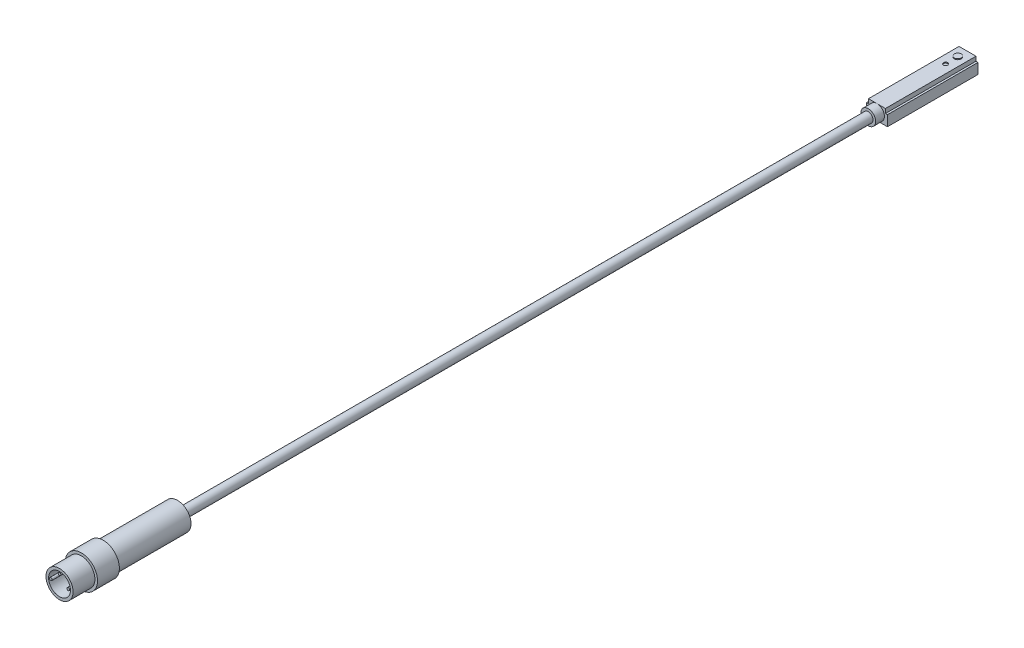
ISO-10303-21;
HEADER;
FILE_DESCRIPTION(('STEP AP214'),'2;1');
FILE_NAME('part.step','',(''),(''),'','','');
FILE_SCHEMA(('AUTOMOTIVE_DESIGN { 1 0 10303 214 1 1 1 1 }'));
ENDSEC;
DATA;
#1=APPLICATION_CONTEXT('core data for automotive mechanical design processes');
#2=APPLICATION_PROTOCOL_DEFINITION('international standard','automotive_design',2000,#1);
#3=PRODUCT_CONTEXT('',#1,'mechanical');
#4=PRODUCT('Part','Part','',(#3));
#5=PRODUCT_RELATED_PRODUCT_CATEGORY('part','',(#4));
#6=PRODUCT_DEFINITION_FORMATION('','',#4);
#7=PRODUCT_DEFINITION_CONTEXT('part definition',#1,'design');
#8=PRODUCT_DEFINITION('design','',#6,#7);
#9=PRODUCT_DEFINITION_SHAPE('','',#8);
#10=(LENGTH_UNIT() NAMED_UNIT(*) SI_UNIT(.MILLI.,.METRE.));
#11=(NAMED_UNIT(*) PLANE_ANGLE_UNIT() SI_UNIT($,.RADIAN.));
#12=(NAMED_UNIT(*) SI_UNIT($,.STERADIAN.) SOLID_ANGLE_UNIT());
#13=UNCERTAINTY_MEASURE_WITH_UNIT(LENGTH_MEASURE(1.E-05),#10,'distance_accuracy_value','');
#14=(GEOMETRIC_REPRESENTATION_CONTEXT(3) GLOBAL_UNCERTAINTY_ASSIGNED_CONTEXT((#13)) GLOBAL_UNIT_ASSIGNED_CONTEXT((#10,
#11,#12)) REPRESENTATION_CONTEXT('',''));
#15=CARTESIAN_POINT('',(0.,0.,0.));
#16=DIRECTION('',(0.,0.,1.));
#17=DIRECTION('',(1.,0.,0.));
#18=AXIS2_PLACEMENT_3D('',#15,#16,#17);
#19=CARTESIAN_POINT('',(0.,2.159,263.906));
#20=DIRECTION('',(0.,0.,-1.));
#21=DIRECTION('',(-1.,0.,0.));
#22=AXIS2_PLACEMENT_3D('',#19,#20,#21);
#23=CYLINDRICAL_SURFACE('',#22,1.397);
#24=CARTESIAN_POINT('',(0.,2.159,28.8544));
#25=DIRECTION('',(0.,0.,-1.));
#26=DIRECTION('',(-1.,0.,0.));
#27=AXIS2_PLACEMENT_3D('',#24,#25,#26);
#28=CIRCLE('',#27,1.397);
#29=CARTESIAN_POINT('',(-1.397,2.159,28.8544));
#30=VERTEX_POINT('',#29);
#31=EDGE_CURVE('E188',#30,#30,#28,.T.);
#32=ORIENTED_EDGE('',*,*,#31,.F.);
#33=EDGE_LOOP('',(#32));
#34=FACE_BOUND('',#33,.T.);
#35=CARTESIAN_POINT('',(0.,2.159,229.616));
#36=DIRECTION('',(0.,0.,1.));
#37=DIRECTION('',(1.,0.,0.));
#38=AXIS2_PLACEMENT_3D('',#35,#36,#37);
#39=CIRCLE('',#38,1.397);
#40=CARTESIAN_POINT('',(1.397,2.159,229.616));
#41=VERTEX_POINT('',#40);
#42=EDGE_CURVE('E38',#41,#41,#39,.F.);
#43=ORIENTED_EDGE('',*,*,#42,.T.);
#44=EDGE_LOOP('',(#43));
#45=FACE_BOUND('',#44,.T.);
#46=ADVANCED_FACE('F34',(#34,#45),#23,.T.);
#47=CARTESIAN_POINT('',(3.048,0.,28.8544));
#48=DIRECTION('',(0.,1.,0.));
#49=DIRECTION('',(0.,0.,1.));
#50=AXIS2_PLACEMENT_3D('',#47,#48,#49);
#51=PLANE('',#50);
#52=DIRECTION('',(1.,0.,0.));
#53=VECTOR('',#52,1.);
#54=CARTESIAN_POINT('',(3.048,0.,26.3144));
#55=LINE('',#54,#53);
#56=CARTESIAN_POINT('',(-3.048,0.,26.3144));
#57=VERTEX_POINT('',#56);
#58=CARTESIAN_POINT('',(0.,0.,26.3144));
#59=VERTEX_POINT('',#58);
#60=EDGE_CURVE('E130',#57,#59,#55,.T.);
#61=ORIENTED_EDGE('',*,*,#60,.F.);
#62=DIRECTION('',(0.,0.,-1.));
#63=VECTOR('',#62,1.);
#64=CARTESIAN_POINT('',(-3.048,0.,28.8544));
#65=LINE('',#64,#63);
#66=CARTESIAN_POINT('',(-3.048,0.,0.));
#67=VERTEX_POINT('',#66);
#68=EDGE_CURVE('E59',#57,#67,#65,.T.);
#69=ORIENTED_EDGE('',*,*,#68,.T.);
#70=DIRECTION('',(1.,0.,0.));
#71=VECTOR('',#70,1.);
#72=CARTESIAN_POINT('',(3.048,0.,0.));
#73=LINE('',#72,#71);
#74=CARTESIAN_POINT('',(3.048,0.,0.));
#75=VERTEX_POINT('',#74);
#76=EDGE_CURVE('E147',#67,#75,#73,.T.);
#77=ORIENTED_EDGE('',*,*,#76,.T.);
#78=DIRECTION('',(0.,0.,-1.));
#79=VECTOR('',#78,1.);
#80=CARTESIAN_POINT('',(3.048,0.,28.8544));
#81=LINE('',#80,#79);
#82=CARTESIAN_POINT('',(3.048,0.,26.3144));
#83=VERTEX_POINT('',#82);
#84=EDGE_CURVE('E180',#83,#75,#81,.T.);
#85=ORIENTED_EDGE('',*,*,#84,.F.);
#86=EDGE_CURVE('E145',#59,#83,#55,.T.);
#87=ORIENTED_EDGE('',*,*,#86,.F.);
#88=EDGE_LOOP('',(#61,#69,#77,#85,#87));
#89=FACE_BOUND('',#88,.T.);
#90=CARTESIAN_POINT('',(0.,0.,2.82240472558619));
#91=DIRECTION('',(0.,1.,0.));
#92=DIRECTION('',(0.,0.,1.));
#93=AXIS2_PLACEMENT_3D('',#90,#91,#92);
#94=CIRCLE('',#93,1.016);
#95=CARTESIAN_POINT('',(0.,0.,3.83840472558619));
#96=VERTEX_POINT('',#95);
#97=EDGE_CURVE('E12',#96,#96,#94,.F.);
#98=ORIENTED_EDGE('',*,*,#97,.F.);
#99=EDGE_LOOP('',(#98));
#100=FACE_BOUND('',#99,.T.);
#101=ADVANCED_FACE('F36',(#89,#100),#51,.F.);
#102=CARTESIAN_POINT('',(-2.4638,4.318,28.8544));
#103=DIRECTION('',(0.,-1.,0.));
#104=DIRECTION('',(0.,0.,-1.));
#105=AXIS2_PLACEMENT_3D('',#102,#103,#104);
#106=PLANE('',#105);
#107=CARTESIAN_POINT('',(0.,4.318,6.35));
#108=DIRECTION('',(0.,1.,0.));
#109=DIRECTION('',(0.,0.,1.));
#110=AXIS2_PLACEMENT_3D('',#107,#108,#109);
#111=CIRCLE('',#110,0.635);
#112=CARTESIAN_POINT('',(0.,4.318,6.985));
#113=VERTEX_POINT('',#112);
#114=EDGE_CURVE('E530',#113,#113,#111,.T.);
#115=ORIENTED_EDGE('',*,*,#114,.F.);
#116=EDGE_LOOP('',(#115));
#117=FACE_BOUND('',#116,.T.);
#118=DIRECTION('',(-1.,0.,0.));
#119=VECTOR('',#118,1.);
#120=CARTESIAN_POINT('',(-2.4638,4.318,26.3144));
#121=LINE('',#120,#119);
#122=CARTESIAN_POINT('',(2.4638,4.318,26.3144));
#123=VERTEX_POINT('',#122);
#124=CARTESIAN_POINT('',(0.,4.318,26.3144));
#125=VERTEX_POINT('',#124);
#126=EDGE_CURVE('E109',#123,#125,#121,.T.);
#127=ORIENTED_EDGE('',*,*,#126,.F.);
#128=DIRECTION('',(0.,0.,-1.));
#129=VECTOR('',#128,1.);
#130=CARTESIAN_POINT('',(2.4638,4.318,28.8544));
#131=LINE('',#130,#129);
#132=CARTESIAN_POINT('',(2.4638,4.318,0.));
#133=VERTEX_POINT('',#132);
#134=EDGE_CURVE('E174',#123,#133,#131,.T.);
#135=ORIENTED_EDGE('',*,*,#134,.T.);
#136=DIRECTION('',(-1.,0.,0.));
#137=VECTOR('',#136,1.);
#138=CARTESIAN_POINT('',(-2.4638,4.318,0.));
#139=LINE('',#138,#137);
#140=CARTESIAN_POINT('',(-2.4638,4.318,0.));
#141=VERTEX_POINT('',#140);
#142=EDGE_CURVE('E158',#133,#141,#139,.T.);
#143=ORIENTED_EDGE('',*,*,#142,.T.);
#144=DIRECTION('',(0.,0.,-1.));
#145=VECTOR('',#144,1.);
#146=CARTESIAN_POINT('',(-2.4638,4.318,28.8544));
#147=LINE('',#146,#145);
#148=CARTESIAN_POINT('',(-2.4638,4.318,26.3144));
#149=VERTEX_POINT('',#148);
#150=EDGE_CURVE('E135',#149,#141,#147,.T.);
#151=ORIENTED_EDGE('',*,*,#150,.F.);
#152=EDGE_CURVE('E119',#125,#149,#121,.T.);
#153=ORIENTED_EDGE('',*,*,#152,.F.);
#154=EDGE_LOOP('',(#127,#135,#143,#151,#153));
#155=FACE_BOUND('',#154,.T.);
#156=CARTESIAN_POINT('',(0.,4.318,2.82240472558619));
#157=DIRECTION('',(0.,-1.,0.));
#158=DIRECTION('',(0.,0.,-1.));
#159=AXIS2_PLACEMENT_3D('',#156,#157,#158);
#160=CIRCLE('',#159,1.016);
#161=CARTESIAN_POINT('',(0.,4.318,1.80640472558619));
#162=VERTEX_POINT('',#161);
#163=EDGE_CURVE('E43',#162,#162,#160,.F.);
#164=ORIENTED_EDGE('',*,*,#163,.F.);
#165=EDGE_LOOP('',(#164));
#166=FACE_BOUND('',#165,.T.);
#167=ADVANCED_FACE('F132',(#117,#155,#166),#106,.F.);
#168=CARTESIAN_POINT('',(3.048,3.048,28.8544));
#169=DIRECTION('',(-1.,0.,0.));
#170=DIRECTION('',(0.,0.,1.));
#171=AXIS2_PLACEMENT_3D('',#168,#169,#170);
#172=PLANE('',#171);
#173=DIRECTION('',(0.,1.,0.));
#174=VECTOR('',#173,1.);
#175=CARTESIAN_POINT('',(3.048,3.048,26.3144));
#176=LINE('',#175,#174);
#177=CARTESIAN_POINT('',(3.048,3.048,26.3144));
#178=VERTEX_POINT('',#177);
#179=EDGE_CURVE('E143',#83,#178,#176,.T.);
#180=ORIENTED_EDGE('',*,*,#179,.F.);
#181=ORIENTED_EDGE('',*,*,#84,.T.);
#182=DIRECTION('',(0.,1.,0.));
#183=VECTOR('',#182,1.);
#184=CARTESIAN_POINT('',(3.048,3.048,0.));
#185=LINE('',#184,#183);
#186=CARTESIAN_POINT('',(3.048,3.048,0.));
#187=VERTEX_POINT('',#186);
#188=EDGE_CURVE('E149',#75,#187,#185,.T.);
#189=ORIENTED_EDGE('',*,*,#188,.T.);
#190=DIRECTION('',(0.,0.,-1.));
#191=VECTOR('',#190,1.);
#192=CARTESIAN_POINT('',(3.048,3.048,28.8544));
#193=LINE('',#192,#191);
#194=EDGE_CURVE('E178',#178,#187,#193,.T.);
#195=ORIENTED_EDGE('',*,*,#194,.F.);
#196=EDGE_LOOP('',(#180,#181,#189,#195));
#197=FACE_BOUND('',#196,.T.);
#198=ADVANCED_FACE('F278',(#197),#172,.F.);
#199=CARTESIAN_POINT('',(2.4638,3.048,28.8544));
#200=DIRECTION('',(0.,-1.,0.));
#201=DIRECTION('',(0.,0.,-1.));
#202=AXIS2_PLACEMENT_3D('',#199,#200,#201);
#203=PLANE('',#202);
#204=DIRECTION('',(-1.,0.,0.));
#205=VECTOR('',#204,1.);
#206=CARTESIAN_POINT('',(2.4638,3.048,26.3144));
#207=LINE('',#206,#205);
#208=CARTESIAN_POINT('',(2.4638,3.048,26.3144));
#209=VERTEX_POINT('',#208);
#210=EDGE_CURVE('E141',#178,#209,#207,.T.);
#211=ORIENTED_EDGE('',*,*,#210,.F.);
#212=ORIENTED_EDGE('',*,*,#194,.T.);
#213=DIRECTION('',(-1.,0.,0.));
#214=VECTOR('',#213,1.);
#215=CARTESIAN_POINT('',(2.4638,3.048,0.));
#216=LINE('',#215,#214);
#217=CARTESIAN_POINT('',(2.4638,3.048,0.));
#218=VERTEX_POINT('',#217);
#219=EDGE_CURVE('E152',#187,#218,#216,.T.);
#220=ORIENTED_EDGE('',*,*,#219,.T.);
#221=DIRECTION('',(0.,0.,-1.));
#222=VECTOR('',#221,1.);
#223=CARTESIAN_POINT('',(2.4638,3.048,28.8544));
#224=LINE('',#223,#222);
#225=EDGE_CURVE('E176',#209,#218,#224,.T.);
#226=ORIENTED_EDGE('',*,*,#225,.F.);
#227=EDGE_LOOP('',(#211,#212,#220,#226));
#228=FACE_BOUND('',#227,.T.);
#229=ADVANCED_FACE('F282',(#228),#203,.F.);
#230=CARTESIAN_POINT('',(2.4638,4.318,28.8544));
#231=DIRECTION('',(-1.,0.,0.));
#232=DIRECTION('',(0.,0.,1.));
#233=AXIS2_PLACEMENT_3D('',#230,#231,#232);
#234=PLANE('',#233);
#235=DIRECTION('',(0.,1.,0.));
#236=VECTOR('',#235,1.);
#237=CARTESIAN_POINT('',(2.4638,4.318,26.3144));
#238=LINE('',#237,#236);
#239=EDGE_CURVE('E115',#209,#123,#238,.T.);
#240=ORIENTED_EDGE('',*,*,#239,.F.);
#241=ORIENTED_EDGE('',*,*,#225,.T.);
#242=DIRECTION('',(0.,1.,0.));
#243=VECTOR('',#242,1.);
#244=CARTESIAN_POINT('',(2.4638,4.318,0.));
#245=LINE('',#244,#243);
#246=EDGE_CURVE('E155',#218,#133,#245,.T.);
#247=ORIENTED_EDGE('',*,*,#246,.T.);
#248=ORIENTED_EDGE('',*,*,#134,.F.);
#249=EDGE_LOOP('',(#240,#241,#247,#248));
#250=FACE_BOUND('',#249,.T.);
#251=ADVANCED_FACE('F274',(#250),#234,.F.);
#252=CARTESIAN_POINT('',(-2.4638,4.318,28.8544));
#253=DIRECTION('',(1.,0.,0.));
#254=DIRECTION('',(0.,0.,-1.));
#255=AXIS2_PLACEMENT_3D('',#252,#253,#254);
#256=PLANE('',#255);
#257=DIRECTION('',(0.,-1.,0.));
#258=VECTOR('',#257,1.);
#259=CARTESIAN_POINT('',(-2.4638,4.318,26.3144));
#260=LINE('',#259,#258);
#261=CARTESIAN_POINT('',(-2.4638,3.048,26.3144));
#262=VERTEX_POINT('',#261);
#263=EDGE_CURVE('E136',#149,#262,#260,.T.);
#264=ORIENTED_EDGE('',*,*,#263,.F.);
#265=ORIENTED_EDGE('',*,*,#150,.T.);
#266=DIRECTION('',(0.,-1.,0.));
#267=VECTOR('',#266,1.);
#268=CARTESIAN_POINT('',(-2.4638,4.318,0.));
#269=LINE('',#268,#267);
#270=CARTESIAN_POINT('',(-2.4638,3.048,0.));
#271=VERTEX_POINT('',#270);
#272=EDGE_CURVE('E160',#141,#271,#269,.T.);
#273=ORIENTED_EDGE('',*,*,#272,.T.);
#274=DIRECTION('',(0.,0.,-1.));
#275=VECTOR('',#274,1.);
#276=CARTESIAN_POINT('',(-2.4638,3.048,28.8544));
#277=LINE('',#276,#275);
#278=EDGE_CURVE('E171',#262,#271,#277,.T.);
#279=ORIENTED_EDGE('',*,*,#278,.F.);
#280=EDGE_LOOP('',(#264,#265,#273,#279));
#281=FACE_BOUND('',#280,.T.);
#282=ADVANCED_FACE('F270',(#281),#256,.F.);
#283=CARTESIAN_POINT('',(-2.4638,3.048,28.8544));
#284=DIRECTION('',(0.,-1.,0.));
#285=DIRECTION('',(0.,0.,-1.));
#286=AXIS2_PLACEMENT_3D('',#283,#284,#285);
#287=PLANE('',#286);
#288=DIRECTION('',(-1.,0.,0.));
#289=VECTOR('',#288,1.);
#290=CARTESIAN_POINT('',(-2.4638,3.048,26.3144));
#291=LINE('',#290,#289);
#292=CARTESIAN_POINT('',(-3.048,3.048,26.3144));
#293=VERTEX_POINT('',#292);
#294=EDGE_CURVE('E51',#262,#293,#291,.T.);
#295=ORIENTED_EDGE('',*,*,#294,.F.);
#296=ORIENTED_EDGE('',*,*,#278,.T.);
#297=DIRECTION('',(-1.,0.,0.));
#298=VECTOR('',#297,1.);
#299=CARTESIAN_POINT('',(-2.4638,3.048,0.));
#300=LINE('',#299,#298);
#301=CARTESIAN_POINT('',(-3.048,3.048,0.));
#302=VERTEX_POINT('',#301);
#303=EDGE_CURVE('E163',#271,#302,#300,.T.);
#304=ORIENTED_EDGE('',*,*,#303,.T.);
#305=DIRECTION('',(0.,0.,-1.));
#306=VECTOR('',#305,1.);
#307=CARTESIAN_POINT('',(-3.048,3.048,28.8544));
#308=LINE('',#307,#306);
#309=EDGE_CURVE('E169',#293,#302,#308,.T.);
#310=ORIENTED_EDGE('',*,*,#309,.F.);
#311=EDGE_LOOP('',(#295,#296,#304,#310));
#312=FACE_BOUND('',#311,.T.);
#313=ADVANCED_FACE('F266',(#312),#287,.F.);
#314=CARTESIAN_POINT('',(-3.048,0.,28.8544));
#315=DIRECTION('',(1.,0.,0.));
#316=DIRECTION('',(0.,0.,-1.));
#317=AXIS2_PLACEMENT_3D('',#314,#315,#316);
#318=PLANE('',#317);
#319=DIRECTION('',(0.,-1.,0.));
#320=VECTOR('',#319,1.);
#321=CARTESIAN_POINT('',(-3.048,0.,26.3144));
#322=LINE('',#321,#320);
#323=EDGE_CURVE('E185',#293,#57,#322,.T.);
#324=ORIENTED_EDGE('',*,*,#323,.F.);
#325=ORIENTED_EDGE('',*,*,#309,.T.);
#326=DIRECTION('',(0.,-1.,0.));
#327=VECTOR('',#326,1.);
#328=CARTESIAN_POINT('',(-3.048,0.,0.));
#329=LINE('',#328,#327);
#330=EDGE_CURVE('E166',#302,#67,#329,.T.);
#331=ORIENTED_EDGE('',*,*,#330,.T.);
#332=ORIENTED_EDGE('',*,*,#68,.F.);
#333=EDGE_LOOP('',(#324,#325,#331,#332));
#334=FACE_BOUND('',#333,.T.);
#335=ADVANCED_FACE('F262',(#334),#318,.F.);
#336=CARTESIAN_POINT('',(-3.048,0.,0.));
#337=DIRECTION('',(0.,0.,-1.));
#338=DIRECTION('',(-1.,0.,0.));
#339=AXIS2_PLACEMENT_3D('',#336,#337,#338);
#340=PLANE('',#339);
#341=ORIENTED_EDGE('',*,*,#76,.F.);
#342=ORIENTED_EDGE('',*,*,#330,.F.);
#343=ORIENTED_EDGE('',*,*,#303,.F.);
#344=ORIENTED_EDGE('',*,*,#272,.F.);
#345=ORIENTED_EDGE('',*,*,#142,.F.);
#346=ORIENTED_EDGE('',*,*,#246,.F.);
#347=ORIENTED_EDGE('',*,*,#219,.F.);
#348=ORIENTED_EDGE('',*,*,#188,.F.);
#349=EDGE_LOOP('',(#341,#342,#343,#344,#345,#346,#347,#348));
#350=FACE_BOUND('',#349,.T.);
#351=ADVANCED_FACE('F258',(#350),#340,.T.);
#352=CARTESIAN_POINT('',(0.,2.159,26.3144));
#353=DIRECTION('',(0.,0.,1.));
#354=DIRECTION('',(1.,0.,0.));
#355=AXIS2_PLACEMENT_3D('',#352,#353,#354);
#356=PLANE('',#355);
#357=ORIENTED_EDGE('',*,*,#60,.T.);
#358=CARTESIAN_POINT('',(0.,2.159,26.3144));
#359=DIRECTION('',(0.,0.,1.));
#360=DIRECTION('',(1.,0.,0.));
#361=AXIS2_PLACEMENT_3D('',#358,#359,#360);
#362=CIRCLE('',#361,2.159);
#363=EDGE_CURVE('E124',#125,#59,#362,.T.);
#364=ORIENTED_EDGE('',*,*,#363,.F.);
#365=ORIENTED_EDGE('',*,*,#152,.T.);
#366=ORIENTED_EDGE('',*,*,#263,.T.);
#367=ORIENTED_EDGE('',*,*,#294,.T.);
#368=ORIENTED_EDGE('',*,*,#323,.T.);
#369=EDGE_LOOP('',(#357,#364,#365,#366,#367,#368));
#370=FACE_BOUND('',#369,.T.);
#371=ADVANCED_FACE('F128',(#370),#356,.T.);
#372=ORIENTED_EDGE('',*,*,#86,.T.);
#373=ORIENTED_EDGE('',*,*,#179,.T.);
#374=ORIENTED_EDGE('',*,*,#210,.T.);
#375=ORIENTED_EDGE('',*,*,#239,.T.);
#376=ORIENTED_EDGE('',*,*,#126,.T.);
#377=EDGE_CURVE('E112',#59,#125,#362,.T.);
#378=ORIENTED_EDGE('',*,*,#377,.F.);
#379=EDGE_LOOP('',(#372,#373,#374,#375,#376,#378));
#380=FACE_BOUND('',#379,.T.);
#381=ADVANCED_FACE('F111',(#380),#356,.T.);
#382=CARTESIAN_POINT('',(0.,2.159,26.3144));
#383=DIRECTION('',(0.,0.,1.));
#384=DIRECTION('',(1.,0.,0.));
#385=AXIS2_PLACEMENT_3D('',#382,#383,#384);
#386=CYLINDRICAL_SURFACE('',#385,2.159);
#387=CARTESIAN_POINT('',(0.,2.159,28.8544));
#388=DIRECTION('',(0.,0.,-1.));
#389=DIRECTION('',(-1.,0.,0.));
#390=AXIS2_PLACEMENT_3D('',#387,#388,#389);
#391=CIRCLE('',#390,2.159);
#392=CARTESIAN_POINT('',(-2.159,2.159,28.8544));
#393=VERTEX_POINT('',#392);
#394=EDGE_CURVE('E182',#393,#393,#391,.T.);
#395=ORIENTED_EDGE('',*,*,#394,.T.);
#396=EDGE_LOOP('',(#395));
#397=FACE_BOUND('',#396,.T.);
#398=ORIENTED_EDGE('',*,*,#363,.T.);
#399=ORIENTED_EDGE('',*,*,#377,.T.);
#400=EDGE_LOOP('',(#398,#399));
#401=FACE_BOUND('',#400,.T.);
#402=ADVANCED_FACE('F123',(#397,#401),#386,.T.);
#403=CARTESIAN_POINT('',(-3.048,0.,28.8544));
#404=DIRECTION('',(0.,0.,-1.));
#405=DIRECTION('',(-1.,0.,0.));
#406=AXIS2_PLACEMENT_3D('',#403,#404,#405);
#407=PLANE('',#406);
#408=ORIENTED_EDGE('',*,*,#31,.T.);
#409=EDGE_LOOP('',(#408));
#410=FACE_BOUND('',#409,.T.);
#411=ORIENTED_EDGE('',*,*,#394,.F.);
#412=EDGE_LOOP('',(#411));
#413=FACE_BOUND('',#412,.T.);
#414=ADVANCED_FACE('F217',(#410,#413),#407,.F.);
#415=CARTESIAN_POINT('',(0.,4.572,2.82240472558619));
#416=DIRECTION('',(0.,-1.,0.));
#417=DIRECTION('',(0.,0.,-1.));
#418=AXIS2_PLACEMENT_3D('',#415,#416,#417);
#419=PLANE('',#418);
#420=CARTESIAN_POINT('',(0.,4.572,2.82240472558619));
#421=DIRECTION('',(0.,-1.,0.));
#422=DIRECTION('',(0.,0.,-1.));
#423=AXIS2_PLACEMENT_3D('',#420,#421,#422);
#424=CIRCLE('',#423,1.016);
#425=CARTESIAN_POINT('',(0.,4.572,1.80640472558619));
#426=VERTEX_POINT('',#425);
#427=EDGE_CURVE('E126',#426,#426,#424,.T.);
#428=ORIENTED_EDGE('',*,*,#427,.F.);
#429=EDGE_LOOP('',(#428));
#430=FACE_BOUND('',#429,.T.);
#431=ADVANCED_FACE('F215',(#430),#419,.F.);
#432=CARTESIAN_POINT('',(0.,-0.762000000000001,2.82240472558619));
#433=DIRECTION('',(0.,-1.,0.));
#434=DIRECTION('',(0.,0.,-1.));
#435=AXIS2_PLACEMENT_3D('',#432,#433,#434);
#436=CYLINDRICAL_SURFACE('',#435,1.016);
#437=ORIENTED_EDGE('',*,*,#427,.T.);
#438=EDGE_LOOP('',(#437));
#439=FACE_BOUND('',#438,.T.);
#440=ORIENTED_EDGE('',*,*,#163,.T.);
#441=EDGE_LOOP('',(#440));
#442=FACE_BOUND('',#441,.T.);
#443=ADVANCED_FACE('F212',(#439,#442),#436,.T.);
#444=CARTESIAN_POINT('',(0.,-0.508,2.82240472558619));
#445=DIRECTION('',(0.,-1.,0.));
#446=DIRECTION('',(0.,0.,-1.));
#447=AXIS2_PLACEMENT_3D('',#444,#445,#446);
#448=CIRCLE('',#447,1.016);
#449=CARTESIAN_POINT('',(0.,-0.508,1.80640472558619));
#450=VERTEX_POINT('',#449);
#451=EDGE_CURVE('E190',#450,#450,#448,.T.);
#452=ORIENTED_EDGE('',*,*,#451,.F.);
#453=EDGE_LOOP('',(#452));
#454=FACE_BOUND('',#453,.T.);
#455=ORIENTED_EDGE('',*,*,#97,.T.);
#456=EDGE_LOOP('',(#455));
#457=FACE_BOUND('',#456,.T.);
#458=ADVANCED_FACE('F223',(#454,#457),#436,.T.);
#459=CARTESIAN_POINT('',(0.,-0.508,3.83840472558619));
#460=DIRECTION('',(0.,1.,0.));
#461=DIRECTION('',(0.,0.,1.));
#462=AXIS2_PLACEMENT_3D('',#459,#460,#461);
#463=PLANE('',#462);
#464=ORIENTED_EDGE('',*,*,#451,.T.);
#465=EDGE_LOOP('',(#464));
#466=FACE_BOUND('',#465,.T.);
#467=ADVANCED_FACE('F237',(#466),#463,.F.);
#468=CARTESIAN_POINT('',(0.,2.159,265.6205));
#469=DIRECTION('',(0.,0.,1.));
#470=DIRECTION('',(1.,0.,0.));
#471=AXIS2_PLACEMENT_3D('',#468,#469,#470);
#472=CYLINDRICAL_SURFACE('',#471,3.937);
#473=CARTESIAN_POINT('',(0.,2.159,263.906));
#474=DIRECTION('',(0.,0.,1.));
#475=DIRECTION('',(1.,0.,0.));
#476=AXIS2_PLACEMENT_3D('',#473,#474,#475);
#477=CIRCLE('',#476,3.937);
#478=CARTESIAN_POINT('',(3.937,2.159,263.906));
#479=VERTEX_POINT('',#478);
#480=EDGE_CURVE('E196',#479,#479,#477,.T.);
#481=ORIENTED_EDGE('',*,*,#480,.F.);
#482=EDGE_LOOP('',(#481));
#483=FACE_BOUND('',#482,.T.);
#484=CARTESIAN_POINT('',(0.,2.159,257.556));
#485=DIRECTION('',(0.,0.,1.));
#486=DIRECTION('',(1.,0.,0.));
#487=AXIS2_PLACEMENT_3D('',#484,#485,#486);
#488=CIRCLE('',#487,3.937);
#489=CARTESIAN_POINT('',(3.937,2.159,257.556));
#490=VERTEX_POINT('',#489);
#491=EDGE_CURVE('E200',#490,#490,#488,.T.);
#492=ORIENTED_EDGE('',*,*,#491,.T.);
#493=EDGE_LOOP('',(#492));
#494=FACE_BOUND('',#493,.T.);
#495=ADVANCED_FACE('F242',(#483,#494),#472,.T.);
#496=CARTESIAN_POINT('',(0.,6.096,257.556));
#497=DIRECTION('',(0.,0.,-1.));
#498=DIRECTION('',(-1.,0.,0.));
#499=AXIS2_PLACEMENT_3D('',#496,#497,#498);
#500=PLANE('',#499);
#501=ORIENTED_EDGE('',*,*,#491,.F.);
#502=EDGE_LOOP('',(#501));
#503=FACE_BOUND('',#502,.T.);
#504=CARTESIAN_POINT('',(0.,2.159,257.556));
#505=DIRECTION('',(0.,0.,1.));
#506=DIRECTION('',(1.,0.,0.));
#507=AXIS2_PLACEMENT_3D('',#504,#505,#506);
#508=CIRCLE('',#507,4.699);
#509=CARTESIAN_POINT('',(4.699,2.159,257.556));
#510=VERTEX_POINT('',#509);
#511=EDGE_CURVE('E205',#510,#510,#508,.T.);
#512=ORIENTED_EDGE('',*,*,#511,.T.);
#513=EDGE_LOOP('',(#512));
#514=FACE_BOUND('',#513,.T.);
#515=ADVANCED_FACE('F251',(#503,#514),#500,.F.);
#516=CARTESIAN_POINT('',(0.,2.159,265.6205));
#517=DIRECTION('',(0.,0.,1.));
#518=DIRECTION('',(1.,0.,0.));
#519=AXIS2_PLACEMENT_3D('',#516,#517,#518);
#520=CYLINDRICAL_SURFACE('',#519,4.699);
#521=ORIENTED_EDGE('',*,*,#511,.F.);
#522=EDGE_LOOP('',(#521));
#523=FACE_BOUND('',#522,.T.);
#524=CARTESIAN_POINT('',(0.,2.159,251.206));
#525=DIRECTION('',(0.,0.,1.));
#526=DIRECTION('',(1.,0.,0.));
#527=AXIS2_PLACEMENT_3D('',#524,#525,#526);
#528=CIRCLE('',#527,4.699);
#529=CARTESIAN_POINT('',(4.699,2.159,251.206));
#530=VERTEX_POINT('',#529);
#531=EDGE_CURVE('E564',#530,#530,#528,.T.);
#532=ORIENTED_EDGE('',*,*,#531,.T.);
#533=EDGE_LOOP('',(#532));
#534=FACE_BOUND('',#533,.T.);
#535=ADVANCED_FACE('F369',(#523,#534),#520,.T.);
#536=CARTESIAN_POINT('',(0.,6.858,251.206));
#537=DIRECTION('',(0.,0.,1.));
#538=DIRECTION('',(1.,0.,0.));
#539=AXIS2_PLACEMENT_3D('',#536,#537,#538);
#540=PLANE('',#539);
#541=ORIENTED_EDGE('',*,*,#531,.F.);
#542=EDGE_LOOP('',(#541));
#543=FACE_BOUND('',#542,.T.);
#544=CARTESIAN_POINT('',(0.,2.159,251.206));
#545=DIRECTION('',(0.,0.,1.));
#546=DIRECTION('',(1.,0.,0.));
#547=AXIS2_PLACEMENT_3D('',#544,#545,#546);
#548=CIRCLE('',#547,3.937);
#549=CARTESIAN_POINT('',(3.937,2.159,251.206));
#550=VERTEX_POINT('',#549);
#551=EDGE_CURVE('E561',#550,#550,#548,.T.);
#552=ORIENTED_EDGE('',*,*,#551,.T.);
#553=EDGE_LOOP('',(#552));
#554=FACE_BOUND('',#553,.T.);
#555=ADVANCED_FACE('F379',(#543,#554),#540,.F.);
#556=CARTESIAN_POINT('',(0.,2.159,265.6205));
#557=DIRECTION('',(0.,0.,1.));
#558=DIRECTION('',(1.,0.,0.));
#559=AXIS2_PLACEMENT_3D('',#556,#557,#558);
#560=CYLINDRICAL_SURFACE('',#559,3.937);
#561=ORIENTED_EDGE('',*,*,#551,.F.);
#562=EDGE_LOOP('',(#561));
#563=FACE_BOUND('',#562,.T.);
#564=CARTESIAN_POINT('',(0.,2.159,229.616));
#565=DIRECTION('',(0.,0.,1.));
#566=DIRECTION('',(1.,0.,0.));
#567=AXIS2_PLACEMENT_3D('',#564,#565,#566);
#568=CIRCLE('',#567,3.937);
#569=CARTESIAN_POINT('',(3.937,2.159,229.616));
#570=VERTEX_POINT('',#569);
#571=EDGE_CURVE('E556',#570,#570,#568,.T.);
#572=ORIENTED_EDGE('',*,*,#571,.T.);
#573=EDGE_LOOP('',(#572));
#574=FACE_BOUND('',#573,.T.);
#575=ADVANCED_FACE('F389',(#563,#574),#560,.T.);
#576=CARTESIAN_POINT('',(0.,6.096,229.616));
#577=DIRECTION('',(0.,0.,1.));
#578=DIRECTION('',(1.,0.,0.));
#579=AXIS2_PLACEMENT_3D('',#576,#577,#578);
#580=PLANE('',#579);
#581=ORIENTED_EDGE('',*,*,#42,.F.);
#582=EDGE_LOOP('',(#581));
#583=FACE_BOUND('',#582,.T.);
#584=ORIENTED_EDGE('',*,*,#571,.F.);
#585=EDGE_LOOP('',(#584));
#586=FACE_BOUND('',#585,.T.);
#587=ADVANCED_FACE('F399',(#583,#586),#580,.F.);
#588=CARTESIAN_POINT('',(0.,2.159,263.906));
#589=DIRECTION('',(0.,0.,-1.));
#590=DIRECTION('',(-1.,0.,0.));
#591=AXIS2_PLACEMENT_3D('',#588,#589,#590);
#592=PLANE('',#591);
#593=CARTESIAN_POINT('',(0.,2.159,263.906));
#594=DIRECTION('',(0.,0.,1.));
#595=DIRECTION('',(1.,0.,0.));
#596=AXIS2_PLACEMENT_3D('',#593,#594,#595);
#597=CIRCLE('',#596,3.175);
#598=CARTESIAN_POINT('',(3.175,2.159,263.906));
#599=VERTEX_POINT('',#598);
#600=EDGE_CURVE('E550',#599,#599,#597,.T.);
#601=ORIENTED_EDGE('',*,*,#600,.F.);
#602=EDGE_LOOP('',(#601));
#603=FACE_BOUND('',#602,.T.);
#604=ORIENTED_EDGE('',*,*,#480,.T.);
#605=EDGE_LOOP('',(#604));
#606=FACE_BOUND('',#605,.T.);
#607=ADVANCED_FACE('F234',(#603,#606),#592,.F.);
#608=CARTESIAN_POINT('',(0.,2.159,258.826));
#609=DIRECTION('',(0.,0.,1.));
#610=DIRECTION('',(1.,0.,0.));
#611=AXIS2_PLACEMENT_3D('',#608,#609,#610);
#612=CYLINDRICAL_SURFACE('',#611,3.175);
#613=CARTESIAN_POINT('',(0.,2.159,258.826));
#614=DIRECTION('',(0.,0.,1.));
#615=DIRECTION('',(1.,0.,0.));
#616=AXIS2_PLACEMENT_3D('',#613,#614,#615);
#617=CIRCLE('',#616,3.175);
#618=CARTESIAN_POINT('',(3.175,2.159,258.826));
#619=VERTEX_POINT('',#618);
#620=EDGE_CURVE('E553',#619,#619,#617,.T.);
#621=ORIENTED_EDGE('',*,*,#620,.F.);
#622=EDGE_LOOP('',(#621));
#623=FACE_BOUND('',#622,.T.);
#624=ORIENTED_EDGE('',*,*,#600,.T.);
#625=EDGE_LOOP('',(#624));
#626=FACE_BOUND('',#625,.T.);
#627=ADVANCED_FACE('F418',(#623,#626),#612,.F.);
#628=CARTESIAN_POINT('',(0.,2.159,258.826));
#629=DIRECTION('',(0.,0.,1.));
#630=DIRECTION('',(1.,0.,0.));
#631=AXIS2_PLACEMENT_3D('',#628,#629,#630);
#632=PLANE('',#631);
#633=CARTESIAN_POINT('',(-2.54,2.159,258.826));
#634=DIRECTION('',(0.,0.,1.));
#635=DIRECTION('',(1.,0.,0.));
#636=AXIS2_PLACEMENT_3D('',#633,#634,#635);
#637=CIRCLE('',#636,0.381);
#638=CARTESIAN_POINT('',(-2.159,2.159,258.826));
#639=VERTEX_POINT('',#638);
#640=EDGE_CURVE('E533',#639,#639,#637,.T.);
#641=ORIENTED_EDGE('',*,*,#640,.F.);
#642=EDGE_LOOP('',(#641));
#643=FACE_BOUND('',#642,.T.);
#644=CARTESIAN_POINT('',(2.54,2.159,258.826));
#645=DIRECTION('',(0.,0.,1.));
#646=DIRECTION('',(1.,0.,0.));
#647=AXIS2_PLACEMENT_3D('',#644,#645,#646);
#648=CIRCLE('',#647,0.381);
#649=CARTESIAN_POINT('',(2.921,2.159,258.826));
#650=VERTEX_POINT('',#649);
#651=EDGE_CURVE('E541',#650,#650,#648,.T.);
#652=ORIENTED_EDGE('',*,*,#651,.F.);
#653=EDGE_LOOP('',(#652));
#654=FACE_BOUND('',#653,.T.);
#655=CARTESIAN_POINT('',(0.,4.699,258.826));
#656=DIRECTION('',(0.,0.,1.));
#657=DIRECTION('',(1.,0.,0.));
#658=AXIS2_PLACEMENT_3D('',#655,#656,#657);
#659=CIRCLE('',#658,0.381);
#660=CARTESIAN_POINT('',(0.381,4.699,258.826));
#661=VERTEX_POINT('',#660);
#662=EDGE_CURVE('E547',#661,#661,#659,.T.);
#663=ORIENTED_EDGE('',*,*,#662,.F.);
#664=EDGE_LOOP('',(#663));
#665=FACE_BOUND('',#664,.T.);
#666=ORIENTED_EDGE('',*,*,#620,.T.);
#667=EDGE_LOOP('',(#666));
#668=FACE_BOUND('',#667,.T.);
#669=ADVANCED_FACE('F430',(#643,#654,#665,#668),#632,.T.);
#670=CARTESIAN_POINT('',(0.,4.699,258.826));
#671=DIRECTION('',(0.,0.,1.));
#672=DIRECTION('',(1.,0.,0.));
#673=AXIS2_PLACEMENT_3D('',#670,#671,#672);
#674=CYLINDRICAL_SURFACE('',#673,0.381);
#675=ORIENTED_EDGE('',*,*,#662,.T.);
#676=EDGE_LOOP('',(#675));
#677=FACE_BOUND('',#676,.T.);
#678=CARTESIAN_POINT('',(0.,4.699,263.906));
#679=DIRECTION('',(0.,0.,1.));
#680=DIRECTION('',(1.,0.,0.));
#681=AXIS2_PLACEMENT_3D('',#678,#679,#680);
#682=CIRCLE('',#681,0.381);
#683=CARTESIAN_POINT('',(0.381,4.699,263.906));
#684=VERTEX_POINT('',#683);
#685=EDGE_CURVE('E544',#684,#684,#682,.T.);
#686=ORIENTED_EDGE('',*,*,#685,.F.);
#687=EDGE_LOOP('',(#686));
#688=FACE_BOUND('',#687,.T.);
#689=ADVANCED_FACE('F441',(#677,#688),#674,.T.);
#690=CARTESIAN_POINT('',(2.54,2.159,258.826));
#691=DIRECTION('',(0.,0.,1.));
#692=DIRECTION('',(1.,0.,0.));
#693=AXIS2_PLACEMENT_3D('',#690,#691,#692);
#694=CYLINDRICAL_SURFACE('',#693,0.381);
#695=ORIENTED_EDGE('',*,*,#651,.T.);
#696=EDGE_LOOP('',(#695));
#697=FACE_BOUND('',#696,.T.);
#698=CARTESIAN_POINT('',(2.54,2.159,263.906));
#699=DIRECTION('',(0.,0.,1.));
#700=DIRECTION('',(1.,0.,0.));
#701=AXIS2_PLACEMENT_3D('',#698,#699,#700);
#702=CIRCLE('',#701,0.381);
#703=CARTESIAN_POINT('',(2.921,2.159,263.906));
#704=VERTEX_POINT('',#703);
#705=EDGE_CURVE('E539',#704,#704,#702,.T.);
#706=ORIENTED_EDGE('',*,*,#705,.F.);
#707=EDGE_LOOP('',(#706));
#708=FACE_BOUND('',#707,.T.);
#709=ADVANCED_FACE('F451',(#697,#708),#694,.T.);
#710=CARTESIAN_POINT('',(-2.54,2.159,258.826));
#711=DIRECTION('',(0.,0.,1.));
#712=DIRECTION('',(1.,0.,0.));
#713=AXIS2_PLACEMENT_3D('',#710,#711,#712);
#714=CYLINDRICAL_SURFACE('',#713,0.381);
#715=ORIENTED_EDGE('',*,*,#640,.T.);
#716=EDGE_LOOP('',(#715));
#717=FACE_BOUND('',#716,.T.);
#718=CARTESIAN_POINT('',(-2.54,2.159,263.906));
#719=DIRECTION('',(0.,0.,1.));
#720=DIRECTION('',(1.,0.,0.));
#721=AXIS2_PLACEMENT_3D('',#718,#719,#720);
#722=CIRCLE('',#721,0.381);
#723=CARTESIAN_POINT('',(-2.159,2.159,263.906));
#724=VERTEX_POINT('',#723);
#725=EDGE_CURVE('E529',#724,#724,#722,.T.);
#726=ORIENTED_EDGE('',*,*,#725,.F.);
#727=EDGE_LOOP('',(#726));
#728=FACE_BOUND('',#727,.T.);
#729=ADVANCED_FACE('F461',(#717,#728),#714,.T.);
#730=ORIENTED_EDGE('',*,*,#705,.T.);
#731=EDGE_LOOP('',(#730));
#732=FACE_BOUND('',#731,.T.);
#733=ADVANCED_FACE('F471',(#732),#592,.F.);
#734=ORIENTED_EDGE('',*,*,#685,.T.);
#735=EDGE_LOOP('',(#734));
#736=FACE_BOUND('',#735,.T.);
#737=ADVANCED_FACE('F420',(#736),#592,.F.);
#738=ORIENTED_EDGE('',*,*,#725,.T.);
#739=EDGE_LOOP('',(#738));
#740=FACE_BOUND('',#739,.T.);
#741=ADVANCED_FACE('F421',(#740),#592,.F.);
#742=CARTESIAN_POINT('',(0.,4.064,6.35));
#743=DIRECTION('',(0.,1.,0.));
#744=DIRECTION('',(0.,0.,1.));
#745=AXIS2_PLACEMENT_3D('',#742,#743,#744);
#746=CYLINDRICAL_SURFACE('',#745,0.635);
#747=CARTESIAN_POINT('',(0.,4.064,6.35));
#748=DIRECTION('',(0.,1.,0.));
#749=DIRECTION('',(0.,0.,1.));
#750=AXIS2_PLACEMENT_3D('',#747,#748,#749);
#751=CIRCLE('',#750,0.635);
#752=CARTESIAN_POINT('',(0.,4.064,6.985));
#753=VERTEX_POINT('',#752);
#754=EDGE_CURVE('E528',#753,#753,#751,.T.);
#755=ORIENTED_EDGE('',*,*,#754,.F.);
#756=EDGE_LOOP('',(#755));
#757=FACE_BOUND('',#756,.T.);
#758=ORIENTED_EDGE('',*,*,#114,.T.);
#759=EDGE_LOOP('',(#758));
#760=FACE_BOUND('',#759,.T.);
#761=ADVANCED_FACE('F498',(#757,#760),#746,.F.);
#762=CARTESIAN_POINT('',(0.,4.064,6.35));
#763=DIRECTION('',(0.,1.,0.));
#764=DIRECTION('',(0.,0.,1.));
#765=AXIS2_PLACEMENT_3D('',#762,#763,#764);
#766=PLANE('',#765);
#767=ORIENTED_EDGE('',*,*,#754,.T.);
#768=EDGE_LOOP('',(#767));
#769=FACE_BOUND('',#768,.T.);
#770=ADVANCED_FACE('F512',(#769),#766,.T.);
#771=CLOSED_SHELL('',(#46,#101,#167,#198,#229,#251,#282,#313,#335,#351,#371,#381,#402,#414,#431,
#443,#458,#467,#495,#515,#535,#555,#575,#587,#607,#627,#669,#689,#709,#729,#733,#737,#741,#761,#770));
#772=MANIFOLD_SOLID_BREP('B2',#771);
#773=ADVANCED_BREP_SHAPE_REPRESENTATION('',(#18,#772),#14);
#774=SHAPE_DEFINITION_REPRESENTATION(#9,#773);
ENDSEC;
END-ISO-10303-21;
